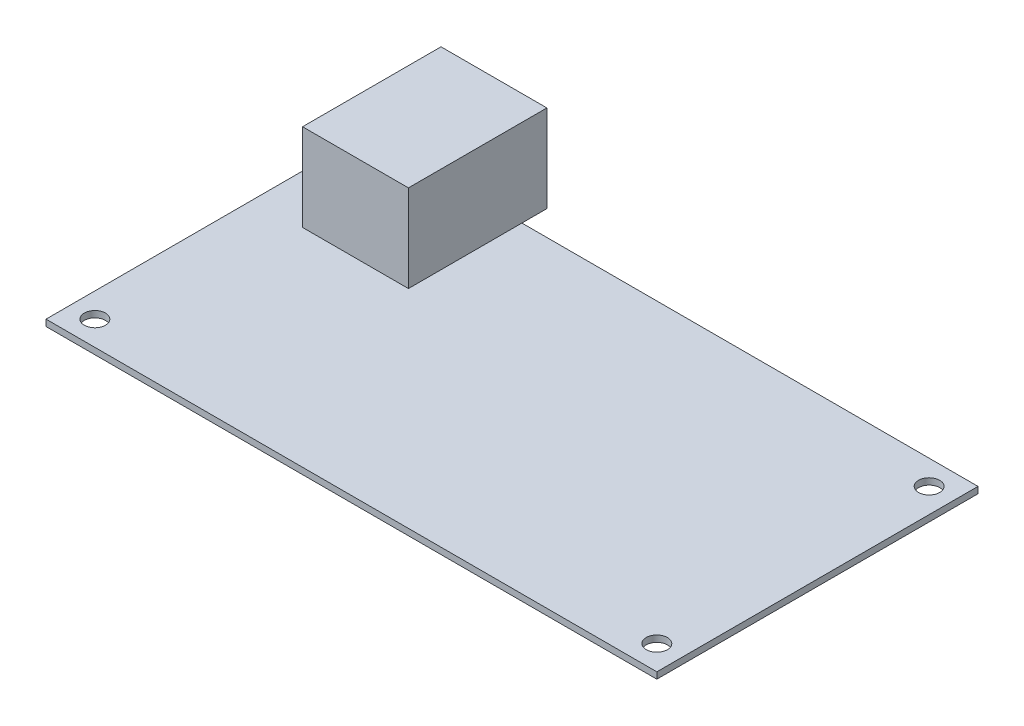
from build123d import *

# Parameters (mm, degrees)
SKETCH1_W      = 95.25
SKETCH1_H      = 50.08
SKETCH1_R      = 1.65
EXTRUDE1_DEPTH = 1
SKETCH2_W      = 16.51
SKETCH2_H      = 21.59
EXTRUDE2_DEPTH = 13.6


with BuildPart() as part:
    # Sketch1 → Extrude1 (new body)
    with BuildSketch(Plane(origin=(0, 0, 0), x_dir=(1, 0, 0), z_dir=(0, 1, 0))):
        with Locations((47.625, 25.04)):
            Rectangle(SKETCH1_W, SKETCH1_H)
        with Locations(Location((3.81, 3.81, 0), (0, 0, 270))):
            Circle(SKETCH1_R, mode=Mode.SUBTRACT)
        with Locations(Location((3.81, 46.27, 0), (0, 0, 270))):
            Circle(SKETCH1_R, mode=Mode.SUBTRACT)
        with Locations(Location((91.44, 46.27, 0), (0, 0, 270))):
            Circle(SKETCH1_R, mode=Mode.SUBTRACT)
        with Locations(Location((91.44, 3.81, 0), (0, 0, 270))):
            Circle(SKETCH1_R, mode=Mode.SUBTRACT)
    extrude(amount=EXTRUDE1_DEPTH)

    # Sketch2 → Extrude2 (add)
    with BuildSketch(Plane(origin=(0, 1, 0), x_dir=(1, 0, 0), z_dir=(0, 1, 0))):
        with Locations((15.875, 43.18)):
            Rectangle(SKETCH2_W, SKETCH2_H)
    extrude(amount=EXTRUDE2_DEPTH)


solid = part.part
